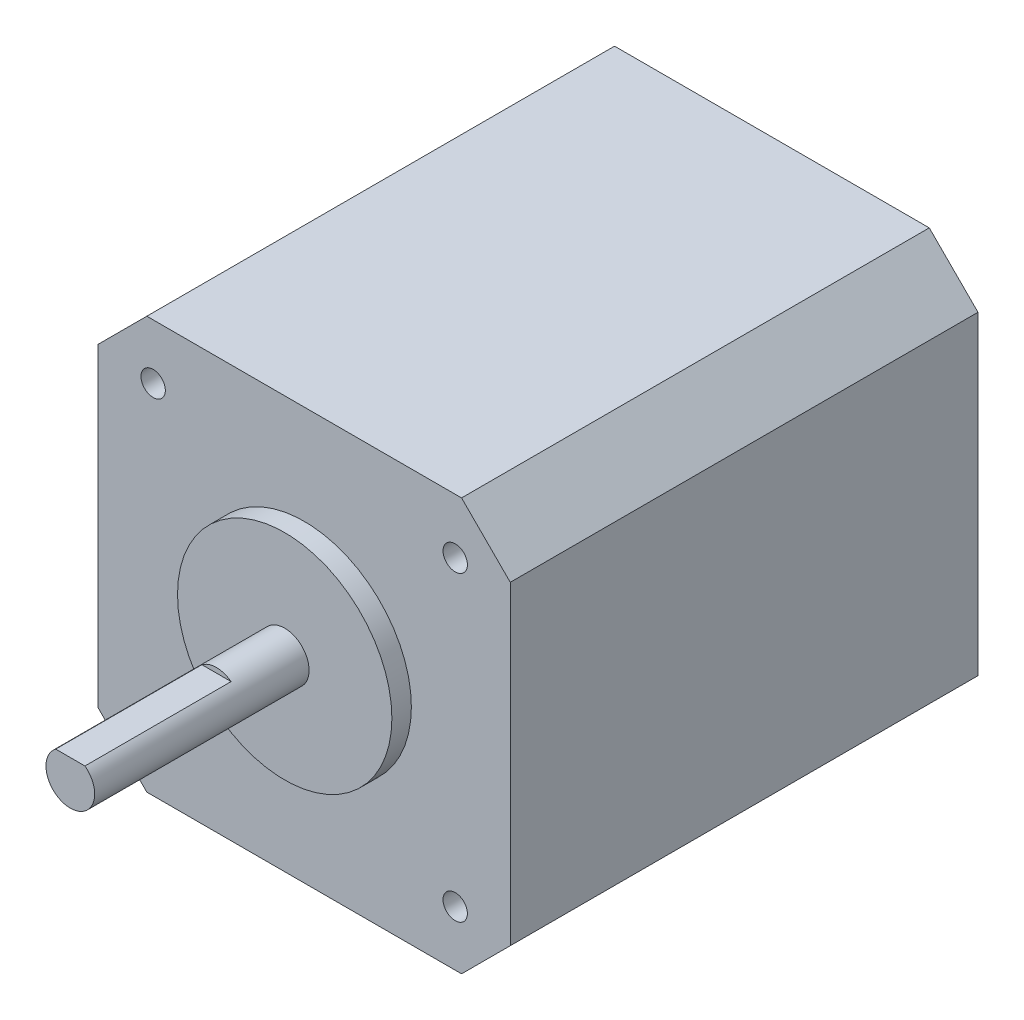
ISO-10303-21;
HEADER;
FILE_DESCRIPTION(('STEP AP214'),'2;1');
FILE_NAME('part.step','',(''),(''),'','','');
FILE_SCHEMA(('AUTOMOTIVE_DESIGN { 1 0 10303 214 1 1 1 1 }'));
ENDSEC;
DATA;
#1=APPLICATION_CONTEXT('core data for automotive mechanical design processes');
#2=APPLICATION_PROTOCOL_DEFINITION('international standard','automotive_design',2000,#1);
#3=PRODUCT_CONTEXT('',#1,'mechanical');
#4=PRODUCT('Part','Part','',(#3));
#5=PRODUCT_RELATED_PRODUCT_CATEGORY('part','',(#4));
#6=PRODUCT_DEFINITION_FORMATION('','',#4);
#7=PRODUCT_DEFINITION_CONTEXT('part definition',#1,'design');
#8=PRODUCT_DEFINITION('design','',#6,#7);
#9=PRODUCT_DEFINITION_SHAPE('','',#8);
#10=(LENGTH_UNIT() NAMED_UNIT(*) SI_UNIT(.MILLI.,.METRE.));
#11=(NAMED_UNIT(*) PLANE_ANGLE_UNIT() SI_UNIT($,.RADIAN.));
#12=(NAMED_UNIT(*) SI_UNIT($,.STERADIAN.) SOLID_ANGLE_UNIT());
#13=UNCERTAINTY_MEASURE_WITH_UNIT(LENGTH_MEASURE(1.E-05),#10,'distance_accuracy_value','');
#14=(GEOMETRIC_REPRESENTATION_CONTEXT(3) GLOBAL_UNCERTAINTY_ASSIGNED_CONTEXT((#13)) GLOBAL_UNIT_ASSIGNED_CONTEXT((#10,
#11,#12)) REPRESENTATION_CONTEXT('',''));
#15=CARTESIAN_POINT('',(0.,0.,0.));
#16=DIRECTION('',(0.,0.,1.));
#17=DIRECTION('',(1.,0.,0.));
#18=AXIS2_PLACEMENT_3D('',#15,#16,#17);
#19=CARTESIAN_POINT('',(21.15,-21.15,24.));
#20=DIRECTION('',(-1.,0.,0.));
#21=DIRECTION('',(0.,0.,1.));
#22=AXIS2_PLACEMENT_3D('',#19,#20,#21);
#23=PLANE('',#22);
#24=DIRECTION('',(0.,1.,0.));
#25=VECTOR('',#24,1.);
#26=CARTESIAN_POINT('',(21.15,-21.15,24.));
#27=LINE('',#26,#25);
#28=CARTESIAN_POINT('',(21.15,-16.15,24.));
#29=VERTEX_POINT('',#28);
#30=CARTESIAN_POINT('',(21.15,16.15,24.));
#31=VERTEX_POINT('',#30);
#32=EDGE_CURVE('E185',#29,#31,#27,.T.);
#33=ORIENTED_EDGE('',*,*,#32,.F.);
#34=DIRECTION('',(0.,0.,-1.));
#35=VECTOR('',#34,1.);
#36=CARTESIAN_POINT('',(21.15,-16.15,24.));
#37=LINE('',#36,#35);
#38=CARTESIAN_POINT('',(21.15,-16.15,-24.));
#39=VERTEX_POINT('',#38);
#40=EDGE_CURVE('E237',#29,#39,#37,.T.);
#41=ORIENTED_EDGE('',*,*,#40,.T.);
#42=DIRECTION('',(0.,1.,0.));
#43=VECTOR('',#42,1.);
#44=CARTESIAN_POINT('',(21.15,-21.15,-24.));
#45=LINE('',#44,#43);
#46=CARTESIAN_POINT('',(21.15,16.15,-24.));
#47=VERTEX_POINT('',#46);
#48=EDGE_CURVE('E184',#39,#47,#45,.T.);
#49=ORIENTED_EDGE('',*,*,#48,.T.);
#50=DIRECTION('',(0.,0.,1.));
#51=VECTOR('',#50,1.);
#52=CARTESIAN_POINT('',(21.15,16.15,24.));
#53=LINE('',#52,#51);
#54=EDGE_CURVE('E236',#47,#31,#53,.T.);
#55=ORIENTED_EDGE('',*,*,#54,.T.);
#56=EDGE_LOOP('',(#33,#41,#49,#55));
#57=FACE_BOUND('',#56,.T.);
#58=ADVANCED_FACE('F43',(#57),#23,.F.);
#59=CARTESIAN_POINT('',(-21.15,21.15,24.));
#60=DIRECTION('',(0.,-1.,0.));
#61=DIRECTION('',(0.,0.,-1.));
#62=AXIS2_PLACEMENT_3D('',#59,#60,#61);
#63=PLANE('',#62);
#64=DIRECTION('',(-1.,0.,0.));
#65=VECTOR('',#64,1.);
#66=CARTESIAN_POINT('',(-21.15,21.15,-24.));
#67=LINE('',#66,#65);
#68=CARTESIAN_POINT('',(16.15,21.15,-24.));
#69=VERTEX_POINT('',#68);
#70=CARTESIAN_POINT('',(-16.15,21.15,-24.));
#71=VERTEX_POINT('',#70);
#72=EDGE_CURVE('E200',#69,#71,#67,.T.);
#73=ORIENTED_EDGE('',*,*,#72,.T.);
#74=DIRECTION('',(0.,0.,1.));
#75=VECTOR('',#74,1.);
#76=CARTESIAN_POINT('',(-16.15,21.15,24.));
#77=LINE('',#76,#75);
#78=CARTESIAN_POINT('',(-16.15,21.15,24.));
#79=VERTEX_POINT('',#78);
#80=EDGE_CURVE('E222',#71,#79,#77,.T.);
#81=ORIENTED_EDGE('',*,*,#80,.T.);
#82=DIRECTION('',(-1.,0.,0.));
#83=VECTOR('',#82,1.);
#84=CARTESIAN_POINT('',(-21.15,21.15,24.));
#85=LINE('',#84,#83);
#86=CARTESIAN_POINT('',(16.15,21.15,24.));
#87=VERTEX_POINT('',#86);
#88=EDGE_CURVE('E188',#87,#79,#85,.T.);
#89=ORIENTED_EDGE('',*,*,#88,.F.);
#90=DIRECTION('',(0.,0.,-1.));
#91=VECTOR('',#90,1.);
#92=CARTESIAN_POINT('',(16.15,21.15,24.));
#93=LINE('',#92,#91);
#94=EDGE_CURVE('E219',#87,#69,#93,.T.);
#95=ORIENTED_EDGE('',*,*,#94,.T.);
#96=EDGE_LOOP('',(#73,#81,#89,#95));
#97=FACE_BOUND('',#96,.T.);
#98=ADVANCED_FACE('F288',(#97),#63,.F.);
#99=CARTESIAN_POINT('',(-21.15,-21.15,24.));
#100=DIRECTION('',(1.,0.,0.));
#101=DIRECTION('',(0.,0.,-1.));
#102=AXIS2_PLACEMENT_3D('',#99,#100,#101);
#103=PLANE('',#102);
#104=DIRECTION('',(0.,-1.,0.));
#105=VECTOR('',#104,1.);
#106=CARTESIAN_POINT('',(-21.15,-21.15,24.));
#107=LINE('',#106,#105);
#108=CARTESIAN_POINT('',(-21.15,16.15,24.));
#109=VERTEX_POINT('',#108);
#110=CARTESIAN_POINT('',(-21.15,-16.15,24.));
#111=VERTEX_POINT('',#110);
#112=EDGE_CURVE('E192',#109,#111,#107,.T.);
#113=ORIENTED_EDGE('',*,*,#112,.F.);
#114=DIRECTION('',(0.,0.,-1.));
#115=VECTOR('',#114,1.);
#116=CARTESIAN_POINT('',(-21.15,16.15,24.));
#117=LINE('',#116,#115);
#118=CARTESIAN_POINT('',(-21.15,16.15,-24.));
#119=VERTEX_POINT('',#118);
#120=EDGE_CURVE('E208',#109,#119,#117,.T.);
#121=ORIENTED_EDGE('',*,*,#120,.T.);
#122=DIRECTION('',(0.,-1.,0.));
#123=VECTOR('',#122,1.);
#124=CARTESIAN_POINT('',(-21.15,-21.15,-24.));
#125=LINE('',#124,#123);
#126=CARTESIAN_POINT('',(-21.15,-16.15,-24.));
#127=VERTEX_POINT('',#126);
#128=EDGE_CURVE('E203',#119,#127,#125,.T.);
#129=ORIENTED_EDGE('',*,*,#128,.T.);
#130=DIRECTION('',(0.,0.,1.));
#131=VECTOR('',#130,1.);
#132=CARTESIAN_POINT('',(-21.15,-16.15,24.));
#133=LINE('',#132,#131);
#134=EDGE_CURVE('E197',#127,#111,#133,.T.);
#135=ORIENTED_EDGE('',*,*,#134,.T.);
#136=EDGE_LOOP('',(#113,#121,#129,#135));
#137=FACE_BOUND('',#136,.T.);
#138=ADVANCED_FACE('F274',(#137),#103,.F.);
#139=CARTESIAN_POINT('',(-21.15,-21.15,24.));
#140=DIRECTION('',(0.,1.,0.));
#141=DIRECTION('',(0.,0.,1.));
#142=AXIS2_PLACEMENT_3D('',#139,#140,#141);
#143=PLANE('',#142);
#144=DIRECTION('',(1.,0.,0.));
#145=VECTOR('',#144,1.);
#146=CARTESIAN_POINT('',(-21.15,-21.15,24.));
#147=LINE('',#146,#145);
#148=CARTESIAN_POINT('',(-16.15,-21.15,24.));
#149=VERTEX_POINT('',#148);
#150=CARTESIAN_POINT('',(16.15,-21.15,24.));
#151=VERTEX_POINT('',#150);
#152=EDGE_CURVE('E195',#149,#151,#147,.T.);
#153=ORIENTED_EDGE('',*,*,#152,.F.);
#154=DIRECTION('',(0.,0.,-1.));
#155=VECTOR('',#154,1.);
#156=CARTESIAN_POINT('',(-16.15,-21.15,24.));
#157=LINE('',#156,#155);
#158=CARTESIAN_POINT('',(-16.15,-21.15,-24.));
#159=VERTEX_POINT('',#158);
#160=EDGE_CURVE('E233',#149,#159,#157,.T.);
#161=ORIENTED_EDGE('',*,*,#160,.T.);
#162=DIRECTION('',(1.,0.,0.));
#163=VECTOR('',#162,1.);
#164=CARTESIAN_POINT('',(-21.15,-21.15,-24.));
#165=LINE('',#164,#163);
#166=CARTESIAN_POINT('',(16.15,-21.15,-24.));
#167=VERTEX_POINT('',#166);
#168=EDGE_CURVE('E189',#159,#167,#165,.T.);
#169=ORIENTED_EDGE('',*,*,#168,.T.);
#170=DIRECTION('',(0.,0.,1.));
#171=VECTOR('',#170,1.);
#172=CARTESIAN_POINT('',(16.15,-21.15,24.));
#173=LINE('',#172,#171);
#174=EDGE_CURVE('E68',#167,#151,#173,.T.);
#175=ORIENTED_EDGE('',*,*,#174,.T.);
#176=EDGE_LOOP('',(#153,#161,#169,#175));
#177=FACE_BOUND('',#176,.T.);
#178=ADVANCED_FACE('F252',(#177),#143,.F.);
#179=CARTESIAN_POINT('',(0.,0.,24.));
#180=DIRECTION('',(0.,0.,-1.));
#181=DIRECTION('',(-1.,0.,0.));
#182=AXIS2_PLACEMENT_3D('',#179,#180,#181);
#183=PLANE('',#182);
#184=CARTESIAN_POINT('',(0.,0.,24.));
#185=DIRECTION('',(0.,0.,-1.));
#186=DIRECTION('',(-1.,0.,0.));
#187=AXIS2_PLACEMENT_3D('',#184,#185,#186);
#188=CIRCLE('',#187,11.);
#189=CARTESIAN_POINT('',(-11.,0.,24.));
#190=VERTEX_POINT('',#189);
#191=EDGE_CURVE('E48',#190,#190,#188,.F.);
#192=ORIENTED_EDGE('',*,*,#191,.F.);
#193=EDGE_LOOP('',(#192));
#194=FACE_BOUND('',#193,.T.);
#195=CARTESIAN_POINT('',(-15.5,15.5,24.));
#196=DIRECTION('',(0.,0.,1.));
#197=DIRECTION('',(1.,0.,0.));
#198=AXIS2_PLACEMENT_3D('',#195,#196,#197);
#199=CIRCLE('',#198,1.25);
#200=CARTESIAN_POINT('',(-14.25,15.5,24.));
#201=VERTEX_POINT('',#200);
#202=EDGE_CURVE('E160',#201,#201,#199,.T.);
#203=ORIENTED_EDGE('',*,*,#202,.F.);
#204=EDGE_LOOP('',(#203));
#205=FACE_BOUND('',#204,.T.);
#206=CARTESIAN_POINT('',(15.5,15.5,24.));
#207=DIRECTION('',(0.,0.,1.));
#208=DIRECTION('',(1.,0.,0.));
#209=AXIS2_PLACEMENT_3D('',#206,#207,#208);
#210=CIRCLE('',#209,1.25);
#211=CARTESIAN_POINT('',(16.75,15.5,24.));
#212=VERTEX_POINT('',#211);
#213=EDGE_CURVE('E166',#212,#212,#210,.T.);
#214=ORIENTED_EDGE('',*,*,#213,.F.);
#215=EDGE_LOOP('',(#214));
#216=FACE_BOUND('',#215,.T.);
#217=CARTESIAN_POINT('',(15.5,-15.5,24.));
#218=DIRECTION('',(0.,0.,1.));
#219=DIRECTION('',(1.,0.,0.));
#220=AXIS2_PLACEMENT_3D('',#217,#218,#219);
#221=CIRCLE('',#220,1.25);
#222=CARTESIAN_POINT('',(16.75,-15.5,24.));
#223=VERTEX_POINT('',#222);
#224=EDGE_CURVE('E172',#223,#223,#221,.T.);
#225=ORIENTED_EDGE('',*,*,#224,.F.);
#226=EDGE_LOOP('',(#225));
#227=FACE_BOUND('',#226,.T.);
#228=CARTESIAN_POINT('',(-15.5,-15.5,24.));
#229=DIRECTION('',(0.,0.,1.));
#230=DIRECTION('',(1.,0.,0.));
#231=AXIS2_PLACEMENT_3D('',#228,#229,#230);
#232=CIRCLE('',#231,1.25);
#233=CARTESIAN_POINT('',(-14.25,-15.5,24.));
#234=VERTEX_POINT('',#233);
#235=EDGE_CURVE('E178',#234,#234,#232,.T.);
#236=ORIENTED_EDGE('',*,*,#235,.F.);
#237=EDGE_LOOP('',(#236));
#238=FACE_BOUND('',#237,.T.);
#239=ORIENTED_EDGE('',*,*,#88,.T.);
#240=DIRECTION('',(0.707106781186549,0.707106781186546,0.));
#241=VECTOR('',#240,1.);
#242=CARTESIAN_POINT('',(-21.15,16.15,24.));
#243=LINE('',#242,#241);
#244=EDGE_CURVE('E230',#79,#109,#243,.F.);
#245=ORIENTED_EDGE('',*,*,#244,.T.);
#246=ORIENTED_EDGE('',*,*,#112,.T.);
#247=DIRECTION('',(-0.707106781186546,0.707106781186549,0.));
#248=VECTOR('',#247,1.);
#249=CARTESIAN_POINT('',(-16.15,-21.15,24.));
#250=LINE('',#249,#248);
#251=EDGE_CURVE('E228',#111,#149,#250,.F.);
#252=ORIENTED_EDGE('',*,*,#251,.T.);
#253=ORIENTED_EDGE('',*,*,#152,.T.);
#254=DIRECTION('',(-0.707106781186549,-0.707106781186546,0.));
#255=VECTOR('',#254,1.);
#256=CARTESIAN_POINT('',(21.15,-16.15,24.));
#257=LINE('',#256,#255);
#258=EDGE_CURVE('E226',#151,#29,#257,.F.);
#259=ORIENTED_EDGE('',*,*,#258,.T.);
#260=ORIENTED_EDGE('',*,*,#32,.T.);
#261=DIRECTION('',(0.707106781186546,-0.707106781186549,0.));
#262=VECTOR('',#261,1.);
#263=CARTESIAN_POINT('',(16.15,21.15,24.));
#264=LINE('',#263,#262);
#265=EDGE_CURVE('E224',#31,#87,#264,.F.);
#266=ORIENTED_EDGE('',*,*,#265,.T.);
#267=EDGE_LOOP('',(#239,#245,#246,#252,#253,#259,#260,#266));
#268=FACE_BOUND('',#267,.T.);
#269=ADVANCED_FACE('F248',(#194,#205,#216,#227,#238,#268),#183,.F.);
#270=CARTESIAN_POINT('',(0.,0.,-24.));
#271=DIRECTION('',(0.,0.,-1.));
#272=DIRECTION('',(-1.,0.,0.));
#273=AXIS2_PLACEMENT_3D('',#270,#271,#272);
#274=PLANE('',#273);
#275=ORIENTED_EDGE('',*,*,#128,.F.);
#276=DIRECTION('',(-0.707106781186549,-0.707106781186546,0.));
#277=VECTOR('',#276,1.);
#278=CARTESIAN_POINT('',(-18.65,18.65,-24.));
#279=LINE('',#278,#277);
#280=EDGE_CURVE('E217',#119,#71,#279,.F.);
#281=ORIENTED_EDGE('',*,*,#280,.T.);
#282=ORIENTED_EDGE('',*,*,#72,.F.);
#283=DIRECTION('',(-0.707106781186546,0.707106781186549,0.));
#284=VECTOR('',#283,1.);
#285=CARTESIAN_POINT('',(18.65,18.65,-24.));
#286=LINE('',#285,#284);
#287=EDGE_CURVE('E211',#69,#47,#286,.F.);
#288=ORIENTED_EDGE('',*,*,#287,.T.);
#289=ORIENTED_EDGE('',*,*,#48,.F.);
#290=DIRECTION('',(0.707106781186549,0.707106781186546,0.));
#291=VECTOR('',#290,1.);
#292=CARTESIAN_POINT('',(18.65,-18.65,-24.));
#293=LINE('',#292,#291);
#294=EDGE_CURVE('E213',#39,#167,#293,.F.);
#295=ORIENTED_EDGE('',*,*,#294,.T.);
#296=ORIENTED_EDGE('',*,*,#168,.F.);
#297=DIRECTION('',(0.707106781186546,-0.707106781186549,0.));
#298=VECTOR('',#297,1.);
#299=CARTESIAN_POINT('',(-18.65,-18.65,-24.));
#300=LINE('',#299,#298);
#301=EDGE_CURVE('E215',#159,#127,#300,.F.);
#302=ORIENTED_EDGE('',*,*,#301,.T.);
#303=EDGE_LOOP('',(#275,#281,#282,#288,#289,#295,#296,#302));
#304=FACE_BOUND('',#303,.T.);
#305=ADVANCED_FACE('F251',(#304),#274,.T.);
#306=CARTESIAN_POINT('',(-15.5,-15.5,19.5));
#307=DIRECTION('',(0.,0.,1.));
#308=DIRECTION('',(1.,0.,0.));
#309=AXIS2_PLACEMENT_3D('',#306,#307,#308);
#310=CONICAL_SURFACE('',#309,1.25,1.02974425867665);
#311=CARTESIAN_POINT('',(-15.5,-15.5,18.7489242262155));
#312=VERTEX_POINT('',#311);
#313=VERTEX_LOOP('',#312);
#314=FACE_BOUND('',#313,.T.);
#315=CARTESIAN_POINT('',(-15.5,-15.5,19.5));
#316=DIRECTION('',(0.,0.,1.));
#317=DIRECTION('',(1.,0.,0.));
#318=AXIS2_PLACEMENT_3D('',#315,#316,#317);
#319=CIRCLE('',#318,1.25);
#320=CARTESIAN_POINT('',(-14.25,-15.5,19.5));
#321=VERTEX_POINT('',#320);
#322=EDGE_CURVE('E181',#321,#321,#319,.T.);
#323=ORIENTED_EDGE('',*,*,#322,.T.);
#324=EDGE_LOOP('',(#323));
#325=FACE_BOUND('',#324,.T.);
#326=ADVANCED_FACE('F356',(#314,#325),#310,.F.);
#327=CARTESIAN_POINT('',(-15.5,-15.5,24.));
#328=DIRECTION('',(0.,0.,1.));
#329=DIRECTION('',(1.,0.,0.));
#330=AXIS2_PLACEMENT_3D('',#327,#328,#329);
#331=CYLINDRICAL_SURFACE('',#330,1.25);
#332=ORIENTED_EDGE('',*,*,#322,.F.);
#333=EDGE_LOOP('',(#332));
#334=FACE_BOUND('',#333,.T.);
#335=ORIENTED_EDGE('',*,*,#235,.T.);
#336=EDGE_LOOP('',(#335));
#337=FACE_BOUND('',#336,.T.);
#338=ADVANCED_FACE('F352',(#334,#337),#331,.F.);
#339=CARTESIAN_POINT('',(15.5,-15.5,19.5));
#340=DIRECTION('',(0.,0.,1.));
#341=DIRECTION('',(1.,0.,0.));
#342=AXIS2_PLACEMENT_3D('',#339,#340,#341);
#343=CONICAL_SURFACE('',#342,1.25,1.02974425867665);
#344=CARTESIAN_POINT('',(15.5,-15.5,18.7489242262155));
#345=VERTEX_POINT('',#344);
#346=VERTEX_LOOP('',#345);
#347=FACE_BOUND('',#346,.T.);
#348=CARTESIAN_POINT('',(15.5,-15.5,19.5));
#349=DIRECTION('',(0.,0.,1.));
#350=DIRECTION('',(1.,0.,0.));
#351=AXIS2_PLACEMENT_3D('',#348,#349,#350);
#352=CIRCLE('',#351,1.25);
#353=CARTESIAN_POINT('',(16.75,-15.5,19.5));
#354=VERTEX_POINT('',#353);
#355=EDGE_CURVE('E175',#354,#354,#352,.T.);
#356=ORIENTED_EDGE('',*,*,#355,.T.);
#357=EDGE_LOOP('',(#356));
#358=FACE_BOUND('',#357,.T.);
#359=ADVANCED_FACE('F348',(#347,#358),#343,.F.);
#360=CARTESIAN_POINT('',(15.5,-15.5,24.));
#361=DIRECTION('',(0.,0.,1.));
#362=DIRECTION('',(1.,0.,0.));
#363=AXIS2_PLACEMENT_3D('',#360,#361,#362);
#364=CYLINDRICAL_SURFACE('',#363,1.25);
#365=ORIENTED_EDGE('',*,*,#355,.F.);
#366=EDGE_LOOP('',(#365));
#367=FACE_BOUND('',#366,.T.);
#368=ORIENTED_EDGE('',*,*,#224,.T.);
#369=EDGE_LOOP('',(#368));
#370=FACE_BOUND('',#369,.T.);
#371=ADVANCED_FACE('F344',(#367,#370),#364,.F.);
#372=CARTESIAN_POINT('',(15.5,15.5,19.5));
#373=DIRECTION('',(0.,0.,1.));
#374=DIRECTION('',(1.,0.,0.));
#375=AXIS2_PLACEMENT_3D('',#372,#373,#374);
#376=CONICAL_SURFACE('',#375,1.25,1.02974425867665);
#377=CARTESIAN_POINT('',(15.5,15.5,18.7489242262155));
#378=VERTEX_POINT('',#377);
#379=VERTEX_LOOP('',#378);
#380=FACE_BOUND('',#379,.T.);
#381=CARTESIAN_POINT('',(15.5,15.5,19.5));
#382=DIRECTION('',(0.,0.,1.));
#383=DIRECTION('',(1.,0.,0.));
#384=AXIS2_PLACEMENT_3D('',#381,#382,#383);
#385=CIRCLE('',#384,1.25);
#386=CARTESIAN_POINT('',(16.75,15.5,19.5));
#387=VERTEX_POINT('',#386);
#388=EDGE_CURVE('E169',#387,#387,#385,.T.);
#389=ORIENTED_EDGE('',*,*,#388,.T.);
#390=EDGE_LOOP('',(#389));
#391=FACE_BOUND('',#390,.T.);
#392=ADVANCED_FACE('F340',(#380,#391),#376,.F.);
#393=CARTESIAN_POINT('',(15.5,15.5,24.));
#394=DIRECTION('',(0.,0.,1.));
#395=DIRECTION('',(1.,0.,0.));
#396=AXIS2_PLACEMENT_3D('',#393,#394,#395);
#397=CYLINDRICAL_SURFACE('',#396,1.25);
#398=ORIENTED_EDGE('',*,*,#388,.F.);
#399=EDGE_LOOP('',(#398));
#400=FACE_BOUND('',#399,.T.);
#401=ORIENTED_EDGE('',*,*,#213,.T.);
#402=EDGE_LOOP('',(#401));
#403=FACE_BOUND('',#402,.T.);
#404=ADVANCED_FACE('F336',(#400,#403),#397,.F.);
#405=CARTESIAN_POINT('',(-15.5,15.5,19.5));
#406=DIRECTION('',(0.,0.,1.));
#407=DIRECTION('',(1.,0.,0.));
#408=AXIS2_PLACEMENT_3D('',#405,#406,#407);
#409=CONICAL_SURFACE('',#408,1.25,1.02974425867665);
#410=CARTESIAN_POINT('',(-15.5,15.5,18.7489242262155));
#411=VERTEX_POINT('',#410);
#412=VERTEX_LOOP('',#411);
#413=FACE_BOUND('',#412,.T.);
#414=CARTESIAN_POINT('',(-15.5,15.5,19.5));
#415=DIRECTION('',(0.,0.,1.));
#416=DIRECTION('',(1.,0.,0.));
#417=AXIS2_PLACEMENT_3D('',#414,#415,#416);
#418=CIRCLE('',#417,1.25);
#419=CARTESIAN_POINT('',(-14.25,15.5,19.5));
#420=VERTEX_POINT('',#419);
#421=EDGE_CURVE('E163',#420,#420,#418,.T.);
#422=ORIENTED_EDGE('',*,*,#421,.T.);
#423=EDGE_LOOP('',(#422));
#424=FACE_BOUND('',#423,.T.);
#425=ADVANCED_FACE('F332',(#413,#424),#409,.F.);
#426=CARTESIAN_POINT('',(-15.5,15.5,24.));
#427=DIRECTION('',(0.,0.,1.));
#428=DIRECTION('',(1.,0.,0.));
#429=AXIS2_PLACEMENT_3D('',#426,#427,#428);
#430=CYLINDRICAL_SURFACE('',#429,1.25);
#431=ORIENTED_EDGE('',*,*,#421,.F.);
#432=EDGE_LOOP('',(#431));
#433=FACE_BOUND('',#432,.T.);
#434=ORIENTED_EDGE('',*,*,#202,.T.);
#435=EDGE_LOOP('',(#434));
#436=FACE_BOUND('',#435,.T.);
#437=ADVANCED_FACE('F305',(#433,#436),#430,.F.);
#438=CARTESIAN_POINT('',(-21.15,16.15,24.));
#439=DIRECTION('',(0.707106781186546,-0.707106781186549,0.));
#440=DIRECTION('',(0.,0.,-1.));
#441=AXIS2_PLACEMENT_3D('',#438,#439,#440);
#442=PLANE('',#441);
#443=ORIENTED_EDGE('',*,*,#244,.F.);
#444=ORIENTED_EDGE('',*,*,#80,.F.);
#445=ORIENTED_EDGE('',*,*,#280,.F.);
#446=ORIENTED_EDGE('',*,*,#120,.F.);
#447=EDGE_LOOP('',(#443,#444,#445,#446));
#448=FACE_BOUND('',#447,.T.);
#449=ADVANCED_FACE('F271',(#448),#442,.F.);
#450=CARTESIAN_POINT('',(-16.15,-21.15,24.));
#451=DIRECTION('',(0.707106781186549,0.707106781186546,0.));
#452=DIRECTION('',(0.,0.,-1.));
#453=AXIS2_PLACEMENT_3D('',#450,#451,#452);
#454=PLANE('',#453);
#455=ORIENTED_EDGE('',*,*,#251,.F.);
#456=ORIENTED_EDGE('',*,*,#134,.F.);
#457=ORIENTED_EDGE('',*,*,#301,.F.);
#458=ORIENTED_EDGE('',*,*,#160,.F.);
#459=EDGE_LOOP('',(#455,#456,#457,#458));
#460=FACE_BOUND('',#459,.T.);
#461=ADVANCED_FACE('F282',(#460),#454,.F.);
#462=CARTESIAN_POINT('',(21.15,-16.15,24.));
#463=DIRECTION('',(-0.707106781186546,0.707106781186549,0.));
#464=DIRECTION('',(0.,0.,-1.));
#465=AXIS2_PLACEMENT_3D('',#462,#463,#464);
#466=PLANE('',#465);
#467=ORIENTED_EDGE('',*,*,#258,.F.);
#468=ORIENTED_EDGE('',*,*,#174,.F.);
#469=ORIENTED_EDGE('',*,*,#294,.F.);
#470=ORIENTED_EDGE('',*,*,#40,.F.);
#471=EDGE_LOOP('',(#467,#468,#469,#470));
#472=FACE_BOUND('',#471,.T.);
#473=ADVANCED_FACE('F285',(#472),#466,.F.);
#474=CARTESIAN_POINT('',(16.15,21.15,24.));
#475=DIRECTION('',(-0.707106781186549,-0.707106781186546,0.));
#476=DIRECTION('',(0.,0.,-1.));
#477=AXIS2_PLACEMENT_3D('',#474,#475,#476);
#478=PLANE('',#477);
#479=ORIENTED_EDGE('',*,*,#265,.F.);
#480=ORIENTED_EDGE('',*,*,#54,.F.);
#481=ORIENTED_EDGE('',*,*,#287,.F.);
#482=ORIENTED_EDGE('',*,*,#94,.F.);
#483=EDGE_LOOP('',(#479,#480,#481,#482));
#484=FACE_BOUND('',#483,.T.);
#485=ADVANCED_FACE('F46',(#484),#478,.F.);
#486=CARTESIAN_POINT('',(0.,0.,26.));
#487=DIRECTION('',(0.,0.,-1.));
#488=DIRECTION('',(-1.,0.,0.));
#489=AXIS2_PLACEMENT_3D('',#486,#487,#488);
#490=CYLINDRICAL_SURFACE('',#489,11.);
#491=CARTESIAN_POINT('',(0.,0.,26.));
#492=DIRECTION('',(0.,0.,1.));
#493=DIRECTION('',(1.,0.,0.));
#494=AXIS2_PLACEMENT_3D('',#491,#492,#493);
#495=CIRCLE('',#494,11.);
#496=CARTESIAN_POINT('',(11.,0.,26.));
#497=VERTEX_POINT('',#496);
#498=EDGE_CURVE('E156',#497,#497,#495,.T.);
#499=ORIENTED_EDGE('',*,*,#498,.F.);
#500=EDGE_LOOP('',(#499));
#501=FACE_BOUND('',#500,.T.);
#502=ORIENTED_EDGE('',*,*,#191,.T.);
#503=EDGE_LOOP('',(#502));
#504=FACE_BOUND('',#503,.T.);
#505=ADVANCED_FACE('F246',(#501,#504),#490,.T.);
#506=CARTESIAN_POINT('',(0.,0.,26.));
#507=DIRECTION('',(0.,0.,1.));
#508=DIRECTION('',(1.,0.,0.));
#509=AXIS2_PLACEMENT_3D('',#506,#507,#508);
#510=PLANE('',#509);
#511=CARTESIAN_POINT('',(0.,0.,26.));
#512=DIRECTION('',(0.,0.,1.));
#513=DIRECTION('',(1.,0.,0.));
#514=AXIS2_PLACEMENT_3D('',#511,#512,#513);
#515=CIRCLE('',#514,2.5);
#516=CARTESIAN_POINT('',(2.5,0.,26.));
#517=VERTEX_POINT('',#516);
#518=EDGE_CURVE('E11',#517,#517,#515,.T.);
#519=ORIENTED_EDGE('',*,*,#518,.F.);
#520=EDGE_LOOP('',(#519));
#521=FACE_BOUND('',#520,.T.);
#522=ORIENTED_EDGE('',*,*,#498,.T.);
#523=EDGE_LOOP('',(#522));
#524=FACE_BOUND('',#523,.T.);
#525=ADVANCED_FACE('F319',(#521,#524),#510,.T.);
#526=CARTESIAN_POINT('',(0.,0.,48.));
#527=DIRECTION('',(0.,0.,-1.));
#528=DIRECTION('',(-1.,0.,0.));
#529=AXIS2_PLACEMENT_3D('',#526,#527,#528);
#530=CYLINDRICAL_SURFACE('',#529,2.5);
#531=CARTESIAN_POINT('',(0.,0.,48.));
#532=DIRECTION('',(0.,0.,1.));
#533=DIRECTION('',(1.,0.,0.));
#534=AXIS2_PLACEMENT_3D('',#531,#532,#533);
#535=CIRCLE('',#534,2.5);
#536=CARTESIAN_POINT('',(-1.5,2.,48.));
#537=VERTEX_POINT('',#536);
#538=CARTESIAN_POINT('',(1.5,2.,48.));
#539=VERTEX_POINT('',#538);
#540=EDGE_CURVE('E151',#537,#539,#535,.T.);
#541=ORIENTED_EDGE('',*,*,#540,.F.);
#542=DIRECTION('',(0.,0.,1.));
#543=VECTOR('',#542,1.);
#544=CARTESIAN_POINT('',(-1.5,2.,33.));
#545=LINE('',#544,#543);
#546=CARTESIAN_POINT('',(-1.5,2.,33.));
#547=VERTEX_POINT('',#546);
#548=EDGE_CURVE('E60',#547,#537,#545,.T.);
#549=ORIENTED_EDGE('',*,*,#548,.F.);
#550=CARTESIAN_POINT('',(0.,0.,33.));
#551=DIRECTION('',(0.,0.,1.));
#552=DIRECTION('',(1.,0.,0.));
#553=AXIS2_PLACEMENT_3D('',#550,#551,#552);
#554=CIRCLE('',#553,2.5);
#555=CARTESIAN_POINT('',(1.5,2.,33.));
#556=VERTEX_POINT('',#555);
#557=EDGE_CURVE('E137',#556,#547,#554,.T.);
#558=ORIENTED_EDGE('',*,*,#557,.F.);
#559=DIRECTION('',(0.,0.,1.));
#560=VECTOR('',#559,1.);
#561=CARTESIAN_POINT('',(1.5,2.,33.));
#562=LINE('',#561,#560);
#563=EDGE_CURVE('E145',#556,#539,#562,.T.);
#564=ORIENTED_EDGE('',*,*,#563,.T.);
#565=EDGE_LOOP('',(#541,#549,#558,#564));
#566=FACE_BOUND('',#565,.T.);
#567=ORIENTED_EDGE('',*,*,#518,.T.);
#568=EDGE_LOOP('',(#567));
#569=FACE_BOUND('',#568,.T.);
#570=ADVANCED_FACE('F148',(#566,#569),#530,.T.);
#571=CARTESIAN_POINT('',(0.,0.,48.));
#572=DIRECTION('',(0.,0.,1.));
#573=DIRECTION('',(1.,0.,0.));
#574=AXIS2_PLACEMENT_3D('',#571,#572,#573);
#575=PLANE('',#574);
#576=DIRECTION('',(1.,0.,0.));
#577=VECTOR('',#576,1.);
#578=CARTESIAN_POINT('',(-1.5,2.,48.));
#579=LINE('',#578,#577);
#580=EDGE_CURVE('E142',#537,#539,#579,.T.);
#581=ORIENTED_EDGE('',*,*,#580,.F.);
#582=ORIENTED_EDGE('',*,*,#540,.T.);
#583=EDGE_LOOP('',(#581,#582));
#584=FACE_BOUND('',#583,.T.);
#585=ADVANCED_FACE('F399',(#584),#575,.T.);
#586=CARTESIAN_POINT('',(-1.5,2.,33.));
#587=DIRECTION('',(0.,-1.,0.));
#588=DIRECTION('',(0.,0.,-1.));
#589=AXIS2_PLACEMENT_3D('',#586,#587,#588);
#590=PLANE('',#589);
#591=ORIENTED_EDGE('',*,*,#580,.T.);
#592=ORIENTED_EDGE('',*,*,#563,.F.);
#593=DIRECTION('',(1.,0.,0.));
#594=VECTOR('',#593,1.);
#595=CARTESIAN_POINT('',(-1.5,2.,33.));
#596=LINE('',#595,#594);
#597=EDGE_CURVE('E139',#547,#556,#596,.T.);
#598=ORIENTED_EDGE('',*,*,#597,.F.);
#599=ORIENTED_EDGE('',*,*,#548,.T.);
#600=EDGE_LOOP('',(#591,#592,#598,#599));
#601=FACE_BOUND('',#600,.T.);
#602=ADVANCED_FACE('F144',(#601),#590,.F.);
#603=CARTESIAN_POINT('',(0.,0.,33.));
#604=DIRECTION('',(0.,0.,1.));
#605=DIRECTION('',(1.,0.,0.));
#606=AXIS2_PLACEMENT_3D('',#603,#604,#605);
#607=PLANE('',#606);
#608=ORIENTED_EDGE('',*,*,#557,.T.);
#609=ORIENTED_EDGE('',*,*,#597,.T.);
#610=EDGE_LOOP('',(#608,#609));
#611=FACE_BOUND('',#610,.T.);
#612=ADVANCED_FACE('F138',(#611),#607,.T.);
#613=CLOSED_SHELL('',(#58,#98,#138,#178,#269,#305,#326,#338,#359,#371,#392,#404,#425,#437,#449,
#461,#473,#485,#505,#525,#570,#585,#602,#612));
#614=MANIFOLD_SOLID_BREP('B2',#613);
#615=ADVANCED_BREP_SHAPE_REPRESENTATION('',(#18,#614),#14);
#616=SHAPE_DEFINITION_REPRESENTATION(#9,#615);
ENDSEC;
END-ISO-10303-21;
